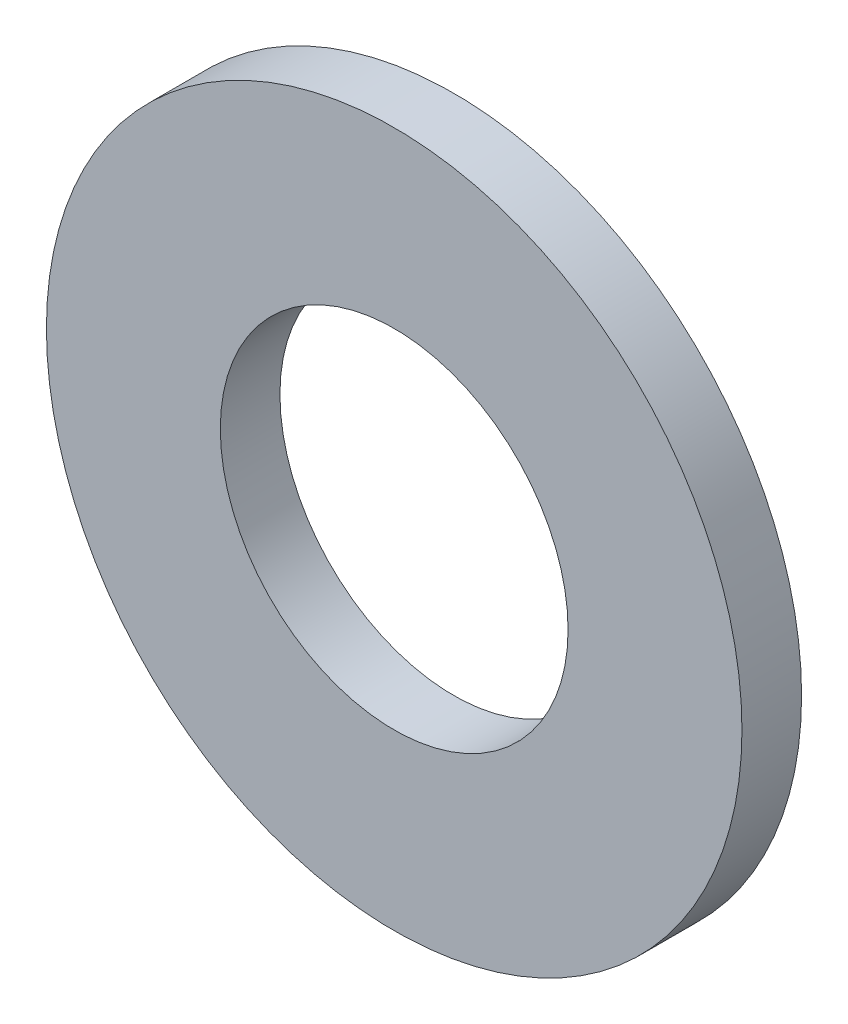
from build123d import *

# Parameters (mm, degrees)
ESQUISSE1_W = 3.5
ESQUISSE1_H = 1.2


with BuildPart() as part:
    # Esquisse1 → R_volution1 (revolve)
    with BuildSketch(Plane(origin=(0, 0, 0), x_dir=(1, 0, 0), z_dir=(0, 1, 0))):
        with Locations((5.25, -0.6)):
            Rectangle(ESQUISSE1_W, ESQUISSE1_H)
    revolve(axis=Axis((0, 0, 0), (0, 0, 1)))


solid = part.part
